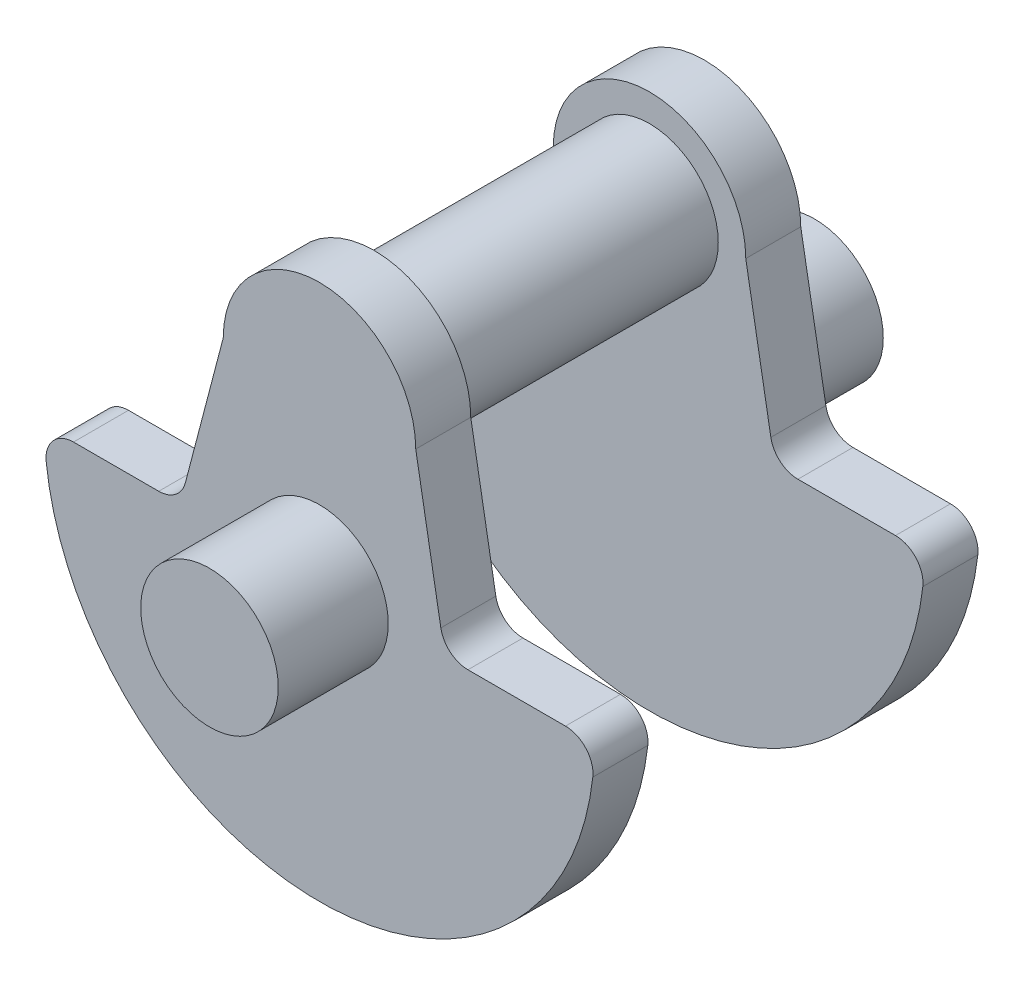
from build123d import *

# Parameters (mm, degrees)
BOSS_EXTRUDE1_DEPTH  = 10
FILLET1_R            = 5
SKETCH2_R            = 12.5
BOSS_EXTRUDE2_DEPTH  = 20
SKETCH3_R            = 12.5
BOSS_EXTRUDE3_DEPTH  = 50
FILLET1_OF_MIRROR2_R = 5


with BuildPart() as part:
    # Sketch1 → Boss-Extrude1 (new body)
    with BuildSketch(Plane.XY):
        with BuildLine():
            Line((22.789809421, 0), (17.5, 30))
            ThreePointArc((17.5, 30), (0, 47.5), (-17.5, 30))
            Line((-17.5, 30), (-25.366568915, 0))
            Line((-25.366568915, 0), (-50, 0))
            ThreePointArc((-50, 0), (0, -50), (50, 0))
            Line((50, 0), (22.789809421, 0))
        make_face()
    boss_extrude1 = extrude(amount=-BOSS_EXTRUDE1_DEPTH)

    # Fillet1
    fillet1_edges = [part.edges().sort_by_distance(p)[0] for p in [
        (22.789809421, 0, -5),
        (50, 0, -5),
        (-50, 0, -5),
        (-25.366568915, 0, -5),
    ]]
    fillet(fillet1_edges, radius=FILLET1_R)

    # Sketch2 → Boss-Extrude2 (add)
    with BuildSketch(Plane.XY):
        Circle(SKETCH2_R)
    boss_extrude2 = extrude(amount=BOSS_EXTRUDE2_DEPTH)

    # Sketch3 → Boss-Extrude3 (add)
    with BuildSketch(Plane(origin=(0, 0, -10), x_dir=(-1, 0, 0), z_dir=(0, 0, -1))):
        with Locations(Location((0, 30, 0), (0, 0, 180))):
            Circle(SKETCH3_R)
    extrude(amount=BOSS_EXTRUDE3_DEPTH)

    # Mirror2: Boss-Extrude1, Boss-Extrude2 across plane
    add(boss_extrude1.mirror(Plane(origin=(0, 0, -35), x_dir=(1, 0, 0), z_dir=(0, 0, -1))))
    add(boss_extrude2.mirror(Plane(origin=(0, 0, -35), x_dir=(1, 0, 0), z_dir=(0, 0, -1))))

    # Fillet1 of Mirror2
    fillet1_of_mirror2_edges = [part.edges().sort_by_distance(p)[0] for p in [
        (22.789809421, 0, -65),
        (50, 0, -65),
        (-50, 0, -65),
        (-25.366568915, 0, -65),
    ]]
    fillet(fillet1_of_mirror2_edges, radius=FILLET1_OF_MIRROR2_R)


solid = part.part
